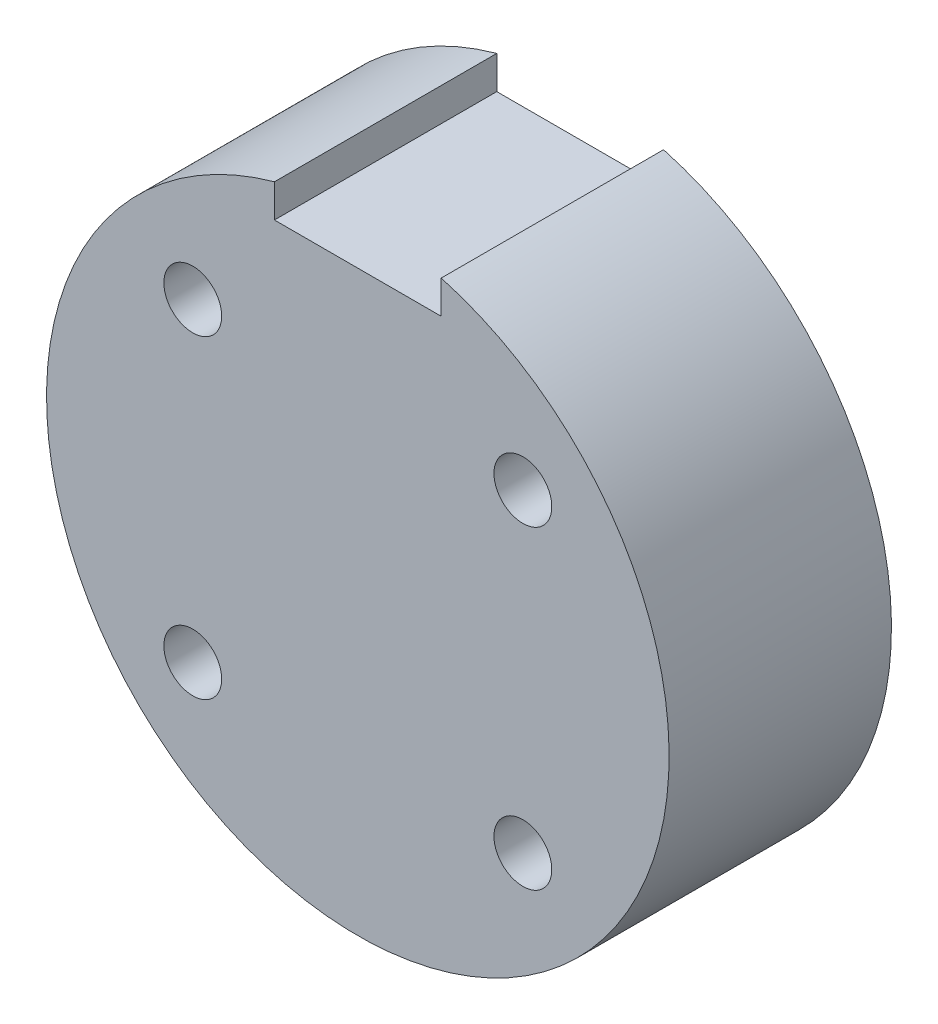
ISO-10303-21;
HEADER;
FILE_DESCRIPTION(('STEP AP214'),'2;1');
FILE_NAME('part.step','',(''),(''),'','','');
FILE_SCHEMA(('AUTOMOTIVE_DESIGN { 1 0 10303 214 1 1 1 1 }'));
ENDSEC;
DATA;
#1=APPLICATION_CONTEXT('core data for automotive mechanical design processes');
#2=APPLICATION_PROTOCOL_DEFINITION('international standard','automotive_design',2000,#1);
#3=PRODUCT_CONTEXT('',#1,'mechanical');
#4=PRODUCT('Part','Part','',(#3));
#5=PRODUCT_RELATED_PRODUCT_CATEGORY('part','',(#4));
#6=PRODUCT_DEFINITION_FORMATION('','',#4);
#7=PRODUCT_DEFINITION_CONTEXT('part definition',#1,'design');
#8=PRODUCT_DEFINITION('design','',#6,#7);
#9=PRODUCT_DEFINITION_SHAPE('','',#8);
#10=(LENGTH_UNIT() NAMED_UNIT(*) SI_UNIT(.MILLI.,.METRE.));
#11=(NAMED_UNIT(*) PLANE_ANGLE_UNIT() SI_UNIT($,.RADIAN.));
#12=(NAMED_UNIT(*) SI_UNIT($,.STERADIAN.) SOLID_ANGLE_UNIT());
#13=UNCERTAINTY_MEASURE_WITH_UNIT(LENGTH_MEASURE(1.E-05),#10,'distance_accuracy_value','');
#14=(GEOMETRIC_REPRESENTATION_CONTEXT(3) GLOBAL_UNCERTAINTY_ASSIGNED_CONTEXT((#13)) GLOBAL_UNIT_ASSIGNED_CONTEXT((#10,
#11,#12)) REPRESENTATION_CONTEXT('',''));
#15=CARTESIAN_POINT('',(0.,0.,0.));
#16=DIRECTION('',(0.,0.,1.));
#17=DIRECTION('',(1.,0.,0.));
#18=AXIS2_PLACEMENT_3D('',#15,#16,#17);
#19=CARTESIAN_POINT('',(0.,0.,20.));
#20=DIRECTION('',(0.,0.,-1.));
#21=DIRECTION('',(-1.,0.,0.));
#22=AXIS2_PLACEMENT_3D('',#19,#20,#21);
#23=CYLINDRICAL_SURFACE('',#22,28.);
#24=CARTESIAN_POINT('',(0.,0.,0.));
#25=DIRECTION('',(0.,0.,1.));
#26=DIRECTION('',(1.,0.,0.));
#27=AXIS2_PLACEMENT_3D('',#24,#25,#26);
#28=CIRCLE('',#27,28.);
#29=CARTESIAN_POINT('',(-7.5,26.9768419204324,0.));
#30=VERTEX_POINT('',#29);
#31=CARTESIAN_POINT('',(7.5,26.9768419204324,0.));
#32=VERTEX_POINT('',#31);
#33=EDGE_CURVE('E56',#30,#32,#28,.T.);
#34=ORIENTED_EDGE('',*,*,#33,.T.);
#35=DIRECTION('',(0.,0.,-1.));
#36=VECTOR('',#35,1.);
#37=CARTESIAN_POINT('',(7.5,26.9768419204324,20.));
#38=LINE('',#37,#36);
#39=CARTESIAN_POINT('',(7.5,26.9768419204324,20.));
#40=VERTEX_POINT('',#39);
#41=EDGE_CURVE('E73',#32,#40,#38,.F.);
#42=ORIENTED_EDGE('',*,*,#41,.T.);
#43=CARTESIAN_POINT('',(0.,0.,20.));
#44=DIRECTION('',(0.,0.,1.));
#45=DIRECTION('',(1.,0.,0.));
#46=AXIS2_PLACEMENT_3D('',#43,#44,#45);
#47=CIRCLE('',#46,28.);
#48=CARTESIAN_POINT('',(-7.5,26.9768419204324,20.));
#49=VERTEX_POINT('',#48);
#50=EDGE_CURVE('E11',#49,#40,#47,.T.);
#51=ORIENTED_EDGE('',*,*,#50,.F.);
#52=DIRECTION('',(0.,0.,-1.));
#53=VECTOR('',#52,1.);
#54=CARTESIAN_POINT('',(-7.5,26.9768419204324,20.));
#55=LINE('',#54,#53);
#56=EDGE_CURVE('E121',#49,#30,#55,.T.);
#57=ORIENTED_EDGE('',*,*,#56,.T.);
#58=EDGE_LOOP('',(#34,#42,#51,#57));
#59=FACE_BOUND('',#58,.T.);
#60=CARTESIAN_POINT('',(0.,-28.,7.5));
#61=CARTESIAN_POINT('',(0.140126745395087,-27.9999985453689,7.50000610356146));
#62=CARTESIAN_POINT('',(0.280347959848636,-27.9989368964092,7.51182094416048));
#63=CARTESIAN_POINT('',(0.556908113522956,-27.9948038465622,7.55877723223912));
#64=CARTESIAN_POINT('',(0.693242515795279,-27.9917301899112,7.59394486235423));
#65=CARTESIAN_POINT('',(0.957983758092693,-27.9839203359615,7.6865793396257));
#66=CARTESIAN_POINT('',(1.08639513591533,-27.9791851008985,7.74403328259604));
#67=CARTESIAN_POINT('',(1.3317217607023,-27.9685825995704,7.87958571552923));
#68=CARTESIAN_POINT('',(1.44863940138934,-27.9627155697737,7.95767989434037));
#69=CARTESIAN_POINT('',(1.66802884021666,-27.9504884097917,8.13254016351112));
#70=CARTESIAN_POINT('',(1.77046264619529,-27.9441270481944,8.22935383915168));
#71=CARTESIAN_POINT('',(1.95765050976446,-27.9316384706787,8.43880398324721));
#72=CARTESIAN_POINT('',(2.04240377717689,-27.9255112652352,8.55144115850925));
#73=CARTESIAN_POINT('',(2.19195559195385,-27.9141717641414,8.78957392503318));
#74=CARTESIAN_POINT('',(2.25672037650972,-27.9089610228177,8.91509080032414));
#75=CARTESIAN_POINT('',(2.36424115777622,-27.9000589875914,9.17527193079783));
#76=CARTESIAN_POINT('',(2.40699759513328,-27.8963676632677,9.30993600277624));
#77=CARTESIAN_POINT('',(2.46917686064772,-27.8909330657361,9.58420558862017));
#78=CARTESIAN_POINT('',(2.48866201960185,-27.8891845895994,9.72379686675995));
#79=CARTESIAN_POINT('',(2.50393821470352,-27.8878173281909,10.0042786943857));
#80=CARTESIAN_POINT('',(2.49972975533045,-27.8881984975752,10.1451692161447));
#81=CARTESIAN_POINT('',(2.4677896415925,-27.8910427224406,10.4238221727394));
#82=CARTESIAN_POINT('',(2.44012583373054,-27.8934997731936,10.5615924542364));
#83=CARTESIAN_POINT('',(2.36216575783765,-27.9002095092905,10.8305266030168));
#84=CARTESIAN_POINT('',(2.31186924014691,-27.9044622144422,10.9616903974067));
#85=CARTESIAN_POINT('',(2.18999587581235,-27.914291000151,11.2139038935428));
#86=CARTESIAN_POINT('',(2.11838870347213,-27.9198689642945,11.3349388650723));
#87=CARTESIAN_POINT('',(1.95594853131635,-27.9317180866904,11.563297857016));
#88=CARTESIAN_POINT('',(1.86511508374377,-27.9379892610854,11.6706215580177));
#89=CARTESIAN_POINT('',(1.6664207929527,-27.9505449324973,11.8689058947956));
#90=CARTESIAN_POINT('',(1.55850131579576,-27.9568293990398,11.9598077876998));
#91=CARTESIAN_POINT('',(1.32890263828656,-27.9686826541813,12.1222135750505));
#92=CARTESIAN_POINT('',(1.2072234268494,-27.9742514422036,12.1937174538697));
#93=CARTESIAN_POINT('',(0.953520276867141,-27.9840471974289,12.3152942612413));
#94=CARTESIAN_POINT('',(0.821495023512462,-27.9882739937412,12.3653644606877));
#95=CARTESIAN_POINT('',(0.550865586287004,-27.9949076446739,12.4426108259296));
#96=CARTESIAN_POINT('',(0.412261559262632,-27.99731454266,12.4697875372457));
#97=CARTESIAN_POINT('',(0.132918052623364,-28.0000316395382,12.5004015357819));
#98=CARTESIAN_POINT('',(-0.00781247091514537,-28.0003490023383,12.503919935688));
#99=CARTESIAN_POINT('',(-0.287861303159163,-27.9988704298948,12.4873301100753));
#100=CARTESIAN_POINT('',(-0.427179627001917,-27.9970745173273,12.4672221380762));
#101=CARTESIAN_POINT('',(-0.700217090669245,-27.9915759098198,12.4040176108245));
#102=CARTESIAN_POINT('',(-0.833945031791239,-27.9878763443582,12.3609587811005));
#103=CARTESIAN_POINT('',(-1.09227863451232,-27.9789858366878,12.2531134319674));
#104=CARTESIAN_POINT('',(-1.21688413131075,-27.9737948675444,12.1883265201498));
#105=CARTESIAN_POINT('',(-1.45380407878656,-27.962485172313,12.0386611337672));
#106=CARTESIAN_POINT('',(-1.56608455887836,-27.9563639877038,11.9537290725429));
#107=CARTESIAN_POINT('',(-1.77482400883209,-27.9438894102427,11.766261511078));
#108=CARTESIAN_POINT('',(-1.871282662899,-27.9375360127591,11.6637256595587));
#109=CARTESIAN_POINT('',(-2.04591973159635,-27.9252917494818,11.4436084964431));
#110=CARTESIAN_POINT('',(-2.12404511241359,-27.9194022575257,11.3259850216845));
#111=CARTESIAN_POINT('',(-2.25943399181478,-27.9087726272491,11.0792407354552));
#112=CARTESIAN_POINT('',(-2.31669772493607,-27.9040324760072,10.9501200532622));
#113=CARTESIAN_POINT('',(-2.40864798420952,-27.8962462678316,10.6842324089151));
#114=CARTESIAN_POINT('',(-2.44336666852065,-27.8931977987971,10.5474766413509));
#115=CARTESIAN_POINT('',(-2.48934587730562,-27.8891322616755,10.2700482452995));
#116=CARTESIAN_POINT('',(-2.50060692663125,-27.8881151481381,10.1293757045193));
#117=CARTESIAN_POINT('',(-2.49934473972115,-27.8882282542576,9.84863399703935));
#118=CARTESIAN_POINT('',(-2.48690482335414,-27.889350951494,9.70856444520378));
#119=CARTESIAN_POINT('',(-2.43876789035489,-27.8936011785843,9.43251278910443));
#120=CARTESIAN_POINT('',(-2.4030708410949,-27.8967287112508,9.29653069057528));
#121=CARTESIAN_POINT('',(-2.30945471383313,-27.9046342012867,9.03251063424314));
#122=CARTESIAN_POINT('',(-2.25153746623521,-27.9094120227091,8.90447202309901));
#123=CARTESIAN_POINT('',(-2.1151340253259,-27.9200800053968,8.65992125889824));
#124=CARTESIAN_POINT('',(-2.03664808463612,-27.9259701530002,8.54340896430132));
#125=CARTESIAN_POINT('',(-1.86102192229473,-27.9382238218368,8.32479143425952));
#126=CARTESIAN_POINT('',(-1.76381982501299,-27.9445888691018,8.22273599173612));
#127=CARTESIAN_POINT('',(-1.55363717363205,-27.9570611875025,8.03634446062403));
#128=CARTESIAN_POINT('',(-1.4406528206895,-27.9631683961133,7.95201265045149));
#129=CARTESIAN_POINT('',(-1.20186417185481,-27.974449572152,7.80333140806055));
#130=CARTESIAN_POINT('',(-1.07603371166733,-27.9796215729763,7.73902388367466));
#131=CARTESIAN_POINT('',(-0.815398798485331,-27.9884271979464,7.63253327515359));
#132=CARTESIAN_POINT('',(-0.680604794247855,-27.9920625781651,7.59032492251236));
#133=CARTESIAN_POINT('',(-0.454188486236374,-27.9964587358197,7.53990501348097));
#134=CARTESIAN_POINT('',(-0.36401947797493,-27.9977806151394,7.5249607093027));
#135=CARTESIAN_POINT('',(-0.182580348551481,-27.9995517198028,7.50500622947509));
#136=CARTESIAN_POINT('',(-0.0913102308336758,-28.0000009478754,7.49999602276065));
#137=CARTESIAN_POINT('',(0.,-28.,7.5));
#138=B_SPLINE_CURVE_WITH_KNOTS('',3,(#60,#61,#62,#63,#64,#65,#66,#67,#68,#69,#70,#71,#72,#73,
#74,#75,#76,#77,#78,#79,#80,#81,#82,#83,#84,#85,#86,#87,#88,#89,#90,#91,#92,#93,#94,#95,#96,#97,
#98,#99,#100,#101,#102,#103,#104,#105,#106,#107,#108,#109,#110,#111,#112,#113,#114,#115,#116,
#117,#118,#119,#120,#121,#122,#123,#124,#125,#126,#127,#128,#129,#130,#131,#132,#133,#134,#135,
#136,#137),.UNSPECIFIED.,.T.,.F.,(4,2,2,2,2,2,2,2,2,2,2,2,2,2,2,2,2,2,2,2,2,2,2,2,2,2,2,2,2,2,2,
2,2,2,2,2,2,2,4),(0.,0.42004683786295,0.840565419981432,1.2608408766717,1.6810286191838,
2.10229887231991,2.52358794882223,2.94558478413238,3.36757316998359,3.78842873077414,
4.20927533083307,4.62890873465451,5.04854676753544,5.46878483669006,5.88903269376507,
6.31075528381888,6.7324782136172,7.15425482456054,7.57602138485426,7.99634117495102,
8.41665645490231,8.83628296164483,9.2559170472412,9.67668014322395,10.0974516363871,
10.5194257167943,10.9413950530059,11.3627611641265,11.7841178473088,12.2039959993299,
12.6238747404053,13.0437189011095,13.4635579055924,13.8848094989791,14.3061626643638,
14.728391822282,15.150137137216,15.4238514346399,15.6975648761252),.UNSPECIFIED.);
#139=CARTESIAN_POINT('',(0.,-28.,7.5));
#140=VERTEX_POINT('',#139);
#141=EDGE_CURVE('E47',#140,#140,#138,.T.);
#142=ORIENTED_EDGE('',*,*,#141,.F.);
#143=EDGE_LOOP('',(#142));
#144=FACE_BOUND('',#143,.T.);
#145=ADVANCED_FACE('F44',(#59,#144),#23,.T.);
#146=CARTESIAN_POINT('',(0.,0.,20.));
#147=DIRECTION('',(0.,0.,1.));
#148=DIRECTION('',(1.,0.,0.));
#149=AXIS2_PLACEMENT_3D('',#146,#147,#148);
#150=PLANE('',#149);
#151=CARTESIAN_POINT('',(14.845865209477,-14.136841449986,20.));
#152=DIRECTION('',(0.,0.,-1.));
#153=DIRECTION('',(-1.,0.,0.));
#154=AXIS2_PLACEMENT_3D('',#151,#152,#153);
#155=CIRCLE('',#154,2.6);
#156=CARTESIAN_POINT('',(12.245865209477,-14.136841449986,20.));
#157=VERTEX_POINT('',#156);
#158=EDGE_CURVE('E128',#157,#157,#155,.T.);
#159=ORIENTED_EDGE('',*,*,#158,.T.);
#160=EDGE_LOOP('',(#159));
#161=FACE_BOUND('',#160,.T.);
#162=CARTESIAN_POINT('',(-14.845865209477,-14.136841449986,20.));
#163=DIRECTION('',(0.,0.,-1.));
#164=DIRECTION('',(-1.,0.,0.));
#165=AXIS2_PLACEMENT_3D('',#162,#163,#164);
#166=CIRCLE('',#165,2.6);
#167=CARTESIAN_POINT('',(-17.445865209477,-14.136841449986,20.));
#168=VERTEX_POINT('',#167);
#169=EDGE_CURVE('E141',#168,#168,#166,.T.);
#170=ORIENTED_EDGE('',*,*,#169,.T.);
#171=EDGE_LOOP('',(#170));
#172=FACE_BOUND('',#171,.T.);
#173=CARTESIAN_POINT('',(-14.845865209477,14.136841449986,20.));
#174=DIRECTION('',(0.,0.,-1.));
#175=DIRECTION('',(-1.,0.,0.));
#176=AXIS2_PLACEMENT_3D('',#173,#174,#175);
#177=CIRCLE('',#176,2.6);
#178=CARTESIAN_POINT('',(-17.445865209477,14.136841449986,20.));
#179=VERTEX_POINT('',#178);
#180=EDGE_CURVE('E134',#179,#179,#177,.T.);
#181=ORIENTED_EDGE('',*,*,#180,.T.);
#182=EDGE_LOOP('',(#181));
#183=FACE_BOUND('',#182,.T.);
#184=CARTESIAN_POINT('',(14.845865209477,14.136841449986,20.));
#185=DIRECTION('',(0.,0.,-1.));
#186=DIRECTION('',(-1.,0.,0.));
#187=AXIS2_PLACEMENT_3D('',#184,#185,#186);
#188=CIRCLE('',#187,2.60000000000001);
#189=CARTESIAN_POINT('',(12.245865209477,14.136841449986,20.));
#190=VERTEX_POINT('',#189);
#191=EDGE_CURVE('E153',#190,#190,#188,.T.);
#192=ORIENTED_EDGE('',*,*,#191,.T.);
#193=EDGE_LOOP('',(#192));
#194=FACE_BOUND('',#193,.T.);
#195=DIRECTION('',(1.,0.,0.));
#196=VECTOR('',#195,1.);
#197=CARTESIAN_POINT('',(-7.5,24.,20.));
#198=LINE('',#197,#196);
#199=CARTESIAN_POINT('',(-7.5,24.,20.));
#200=VERTEX_POINT('',#199);
#201=CARTESIAN_POINT('',(7.5,24.,20.));
#202=VERTEX_POINT('',#201);
#203=EDGE_CURVE('E105',#200,#202,#198,.T.);
#204=ORIENTED_EDGE('',*,*,#203,.F.);
#205=DIRECTION('',(0.,1.,0.));
#206=VECTOR('',#205,1.);
#207=CARTESIAN_POINT('',(-7.5,24.,20.));
#208=LINE('',#207,#206);
#209=EDGE_CURVE('E100',#200,#49,#208,.T.);
#210=ORIENTED_EDGE('',*,*,#209,.T.);
#211=ORIENTED_EDGE('',*,*,#50,.T.);
#212=DIRECTION('',(0.,1.,0.));
#213=VECTOR('',#212,1.);
#214=CARTESIAN_POINT('',(7.5,24.,20.));
#215=LINE('',#214,#213);
#216=EDGE_CURVE('E118',#202,#40,#215,.T.);
#217=ORIENTED_EDGE('',*,*,#216,.F.);
#218=EDGE_LOOP('',(#204,#210,#211,#217));
#219=FACE_BOUND('',#218,.T.);
#220=ADVANCED_FACE('F164',(#161,#172,#183,#194,#219),#150,.T.);
#221=CARTESIAN_POINT('',(0.,0.,0.));
#222=DIRECTION('',(0.,0.,1.));
#223=DIRECTION('',(1.,0.,0.));
#224=AXIS2_PLACEMENT_3D('',#221,#222,#223);
#225=PLANE('',#224);
#226=CARTESIAN_POINT('',(0.,0.,0.));
#227=DIRECTION('',(0.,0.,-1.));
#228=DIRECTION('',(-1.,0.,0.));
#229=AXIS2_PLACEMENT_3D('',#226,#227,#228);
#230=CIRCLE('',#229,7.5);
#231=CARTESIAN_POINT('',(-7.5,0.,0.));
#232=VERTEX_POINT('',#231);
#233=EDGE_CURVE('E176',#232,#232,#230,.T.);
#234=ORIENTED_EDGE('',*,*,#233,.F.);
#235=EDGE_LOOP('',(#234));
#236=FACE_BOUND('',#235,.T.);
#237=DIRECTION('',(-1.,0.,0.));
#238=VECTOR('',#237,1.);
#239=CARTESIAN_POINT('',(-7.5,24.,0.));
#240=LINE('',#239,#238);
#241=CARTESIAN_POINT('',(7.5,24.,0.));
#242=VERTEX_POINT('',#241);
#243=CARTESIAN_POINT('',(-7.5,24.,0.));
#244=VERTEX_POINT('',#243);
#245=EDGE_CURVE('E101',#242,#244,#240,.T.);
#246=ORIENTED_EDGE('',*,*,#245,.F.);
#247=DIRECTION('',(0.,1.,0.));
#248=VECTOR('',#247,1.);
#249=CARTESIAN_POINT('',(7.5,24.,0.));
#250=LINE('',#249,#248);
#251=EDGE_CURVE('E114',#242,#32,#250,.T.);
#252=ORIENTED_EDGE('',*,*,#251,.T.);
#253=ORIENTED_EDGE('',*,*,#33,.F.);
#254=DIRECTION('',(0.,1.,0.));
#255=VECTOR('',#254,1.);
#256=CARTESIAN_POINT('',(-7.5,24.,0.));
#257=LINE('',#256,#255);
#258=EDGE_CURVE('E98',#244,#30,#257,.T.);
#259=ORIENTED_EDGE('',*,*,#258,.F.);
#260=EDGE_LOOP('',(#246,#252,#253,#259));
#261=FACE_BOUND('',#260,.T.);
#262=CARTESIAN_POINT('',(14.845865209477,-14.136841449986,0.));
#263=DIRECTION('',(0.,0.,-1.));
#264=DIRECTION('',(-1.,0.,0.));
#265=AXIS2_PLACEMENT_3D('',#262,#263,#264);
#266=CIRCLE('',#265,2.6);
#267=CARTESIAN_POINT('',(12.245865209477,-14.136841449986,0.));
#268=VERTEX_POINT('',#267);
#269=EDGE_CURVE('E147',#268,#268,#266,.T.);
#270=ORIENTED_EDGE('',*,*,#269,.F.);
#271=EDGE_LOOP('',(#270));
#272=FACE_BOUND('',#271,.T.);
#273=CARTESIAN_POINT('',(-14.845865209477,-14.136841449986,0.));
#274=DIRECTION('',(0.,0.,-1.));
#275=DIRECTION('',(-1.,0.,0.));
#276=AXIS2_PLACEMENT_3D('',#273,#274,#275);
#277=CIRCLE('',#276,2.6);
#278=CARTESIAN_POINT('',(-17.445865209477,-14.136841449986,0.));
#279=VERTEX_POINT('',#278);
#280=EDGE_CURVE('E138',#279,#279,#277,.T.);
#281=ORIENTED_EDGE('',*,*,#280,.F.);
#282=EDGE_LOOP('',(#281));
#283=FACE_BOUND('',#282,.T.);
#284=CARTESIAN_POINT('',(-14.845865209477,14.136841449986,0.));
#285=DIRECTION('',(0.,0.,-1.));
#286=DIRECTION('',(-1.,0.,0.));
#287=AXIS2_PLACEMENT_3D('',#284,#285,#286);
#288=CIRCLE('',#287,2.6);
#289=CARTESIAN_POINT('',(-17.445865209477,14.136841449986,0.));
#290=VERTEX_POINT('',#289);
#291=EDGE_CURVE('E130',#290,#290,#288,.T.);
#292=ORIENTED_EDGE('',*,*,#291,.F.);
#293=EDGE_LOOP('',(#292));
#294=FACE_BOUND('',#293,.T.);
#295=CARTESIAN_POINT('',(14.845865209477,14.136841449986,0.));
#296=DIRECTION('',(0.,0.,-1.));
#297=DIRECTION('',(-1.,0.,0.));
#298=AXIS2_PLACEMENT_3D('',#295,#296,#297);
#299=CIRCLE('',#298,2.60000000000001);
#300=CARTESIAN_POINT('',(12.245865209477,14.136841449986,0.));
#301=VERTEX_POINT('',#300);
#302=EDGE_CURVE('E133',#301,#301,#299,.T.);
#303=ORIENTED_EDGE('',*,*,#302,.F.);
#304=EDGE_LOOP('',(#303));
#305=FACE_BOUND('',#304,.T.);
#306=ADVANCED_FACE('F111',(#236,#261,#272,#283,#294,#305),#225,.F.);
#307=CARTESIAN_POINT('',(14.845865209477,14.136841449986,20.));
#308=DIRECTION('',(0.,0.,-1.));
#309=DIRECTION('',(-1.,0.,0.));
#310=AXIS2_PLACEMENT_3D('',#307,#308,#309);
#311=CYLINDRICAL_SURFACE('',#310,2.60000000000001);
#312=ORIENTED_EDGE('',*,*,#191,.F.);
#313=EDGE_LOOP('',(#312));
#314=FACE_BOUND('',#313,.T.);
#315=ORIENTED_EDGE('',*,*,#302,.T.);
#316=EDGE_LOOP('',(#315));
#317=FACE_BOUND('',#316,.T.);
#318=ADVANCED_FACE('F202',(#314,#317),#311,.F.);
#319=CARTESIAN_POINT('',(-14.845865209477,14.136841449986,20.));
#320=DIRECTION('',(0.,0.,-1.));
#321=DIRECTION('',(-1.,0.,0.));
#322=AXIS2_PLACEMENT_3D('',#319,#320,#321);
#323=CYLINDRICAL_SURFACE('',#322,2.6);
#324=ORIENTED_EDGE('',*,*,#180,.F.);
#325=EDGE_LOOP('',(#324));
#326=FACE_BOUND('',#325,.T.);
#327=ORIENTED_EDGE('',*,*,#291,.T.);
#328=EDGE_LOOP('',(#327));
#329=FACE_BOUND('',#328,.T.);
#330=ADVANCED_FACE('F211',(#326,#329),#323,.F.);
#331=CARTESIAN_POINT('',(-14.845865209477,-14.136841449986,20.));
#332=DIRECTION('',(0.,0.,-1.));
#333=DIRECTION('',(-1.,0.,0.));
#334=AXIS2_PLACEMENT_3D('',#331,#332,#333);
#335=CYLINDRICAL_SURFACE('',#334,2.6);
#336=ORIENTED_EDGE('',*,*,#169,.F.);
#337=EDGE_LOOP('',(#336));
#338=FACE_BOUND('',#337,.T.);
#339=ORIENTED_EDGE('',*,*,#280,.T.);
#340=EDGE_LOOP('',(#339));
#341=FACE_BOUND('',#340,.T.);
#342=ADVANCED_FACE('F215',(#338,#341),#335,.F.);
#343=CARTESIAN_POINT('',(14.845865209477,-14.136841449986,20.));
#344=DIRECTION('',(0.,0.,-1.));
#345=DIRECTION('',(-1.,0.,0.));
#346=AXIS2_PLACEMENT_3D('',#343,#344,#345);
#347=CYLINDRICAL_SURFACE('',#346,2.6);
#348=ORIENTED_EDGE('',*,*,#158,.F.);
#349=EDGE_LOOP('',(#348));
#350=FACE_BOUND('',#349,.T.);
#351=ORIENTED_EDGE('',*,*,#269,.T.);
#352=EDGE_LOOP('',(#351));
#353=FACE_BOUND('',#352,.T.);
#354=ADVANCED_FACE('F214',(#350,#353),#347,.F.);
#355=CARTESIAN_POINT('',(7.5,24.,0.));
#356=DIRECTION('',(1.,0.,0.));
#357=DIRECTION('',(0.,0.,-1.));
#358=AXIS2_PLACEMENT_3D('',#355,#356,#357);
#359=PLANE('',#358);
#360=ORIENTED_EDGE('',*,*,#251,.F.);
#361=DIRECTION('',(0.,0.,-1.));
#362=VECTOR('',#361,1.);
#363=CARTESIAN_POINT('',(7.5,24.,0.));
#364=LINE('',#363,#362);
#365=EDGE_CURVE('E70',#202,#242,#364,.T.);
#366=ORIENTED_EDGE('',*,*,#365,.F.);
#367=ORIENTED_EDGE('',*,*,#216,.T.);
#368=ORIENTED_EDGE('',*,*,#41,.F.);
#369=EDGE_LOOP('',(#360,#366,#367,#368));
#370=FACE_BOUND('',#369,.T.);
#371=ADVANCED_FACE('F167',(#370),#359,.F.);
#372=CARTESIAN_POINT('',(-7.5,24.,0.));
#373=DIRECTION('',(-1.,0.,0.));
#374=DIRECTION('',(0.,0.,1.));
#375=AXIS2_PLACEMENT_3D('',#372,#373,#374);
#376=PLANE('',#375);
#377=ORIENTED_EDGE('',*,*,#209,.F.);
#378=DIRECTION('',(0.,0.,1.));
#379=VECTOR('',#378,1.);
#380=CARTESIAN_POINT('',(-7.5,24.,0.));
#381=LINE('',#380,#379);
#382=EDGE_CURVE('E95',#244,#200,#381,.T.);
#383=ORIENTED_EDGE('',*,*,#382,.F.);
#384=ORIENTED_EDGE('',*,*,#258,.T.);
#385=ORIENTED_EDGE('',*,*,#56,.F.);
#386=EDGE_LOOP('',(#377,#383,#384,#385));
#387=FACE_BOUND('',#386,.T.);
#388=ADVANCED_FACE('F93',(#387),#376,.F.);
#389=CARTESIAN_POINT('',(0.,24.,0.));
#390=DIRECTION('',(0.,1.,0.));
#391=DIRECTION('',(0.,0.,1.));
#392=AXIS2_PLACEMENT_3D('',#389,#390,#391);
#393=PLANE('',#392);
#394=ORIENTED_EDGE('',*,*,#365,.T.);
#395=ORIENTED_EDGE('',*,*,#245,.T.);
#396=ORIENTED_EDGE('',*,*,#382,.T.);
#397=ORIENTED_EDGE('',*,*,#203,.T.);
#398=EDGE_LOOP('',(#394,#395,#396,#397));
#399=FACE_BOUND('',#398,.T.);
#400=ADVANCED_FACE('F106',(#399),#393,.T.);
#401=CARTESIAN_POINT('',(0.,0.,8.));
#402=DIRECTION('',(0.,0.,-1.));
#403=DIRECTION('',(-1.,0.,0.));
#404=AXIS2_PLACEMENT_3D('',#401,#402,#403);
#405=CYLINDRICAL_SURFACE('',#404,7.5);
#406=CARTESIAN_POINT('',(0.,0.,8.));
#407=DIRECTION('',(0.,0.,-1.));
#408=DIRECTION('',(-1.,0.,0.));
#409=AXIS2_PLACEMENT_3D('',#406,#407,#408);
#410=CIRCLE('',#409,7.5);
#411=CARTESIAN_POINT('',(-7.5,0.,8.));
#412=VERTEX_POINT('',#411);
#413=EDGE_CURVE('E175',#412,#412,#410,.T.);
#414=ORIENTED_EDGE('',*,*,#413,.F.);
#415=EDGE_LOOP('',(#414));
#416=FACE_BOUND('',#415,.T.);
#417=ORIENTED_EDGE('',*,*,#233,.T.);
#418=EDGE_LOOP('',(#417));
#419=FACE_BOUND('',#418,.T.);
#420=ADVANCED_FACE('F226',(#416,#419),#405,.F.);
#421=CARTESIAN_POINT('',(0.,0.,8.));
#422=DIRECTION('',(0.,0.,-1.));
#423=DIRECTION('',(-1.,0.,0.));
#424=AXIS2_PLACEMENT_3D('',#421,#422,#423);
#425=PLANE('',#424);
#426=ORIENTED_EDGE('',*,*,#413,.T.);
#427=EDGE_LOOP('',(#426));
#428=FACE_BOUND('',#427,.T.);
#429=ADVANCED_FACE('F233',(#428),#425,.T.);
#430=CARTESIAN_POINT('',(0.,-14.,10.));
#431=DIRECTION('',(0.,-1.,0.));
#432=DIRECTION('',(0.,0.,-1.));
#433=AXIS2_PLACEMENT_3D('',#430,#431,#432);
#434=CYLINDRICAL_SURFACE('',#433,2.5);
#435=CARTESIAN_POINT('',(0.,-14.,10.));
#436=DIRECTION('',(0.,1.,0.));
#437=DIRECTION('',(0.,0.,1.));
#438=AXIS2_PLACEMENT_3D('',#435,#436,#437);
#439=CIRCLE('',#438,2.5);
#440=CARTESIAN_POINT('',(0.,-14.,12.5));
#441=VERTEX_POINT('',#440);
#442=EDGE_CURVE('E185',#441,#441,#439,.T.);
#443=ORIENTED_EDGE('',*,*,#442,.T.);
#444=EDGE_LOOP('',(#443));
#445=FACE_BOUND('',#444,.T.);
#446=ORIENTED_EDGE('',*,*,#141,.T.);
#447=EDGE_LOOP('',(#446));
#448=FACE_BOUND('',#447,.T.);
#449=ADVANCED_FACE('F191',(#445,#448),#434,.F.);
#450=CARTESIAN_POINT('',(0.,-14.,10.));
#451=DIRECTION('',(0.,1.,0.));
#452=DIRECTION('',(0.,0.,1.));
#453=AXIS2_PLACEMENT_3D('',#450,#451,#452);
#454=PLANE('',#453);
#455=ORIENTED_EDGE('',*,*,#442,.F.);
#456=EDGE_LOOP('',(#455));
#457=FACE_BOUND('',#456,.T.);
#458=ADVANCED_FACE('F236',(#457),#454,.F.);
#459=CLOSED_SHELL('',(#145,#220,#306,#318,#330,#342,#354,#371,#388,#400,#420,#429,#449,#458));
#460=MANIFOLD_SOLID_BREP('B2',#459);
#461=ADVANCED_BREP_SHAPE_REPRESENTATION('',(#18,#460),#14);
#462=SHAPE_DEFINITION_REPRESENTATION(#9,#461);
ENDSEC;
END-ISO-10303-21;
